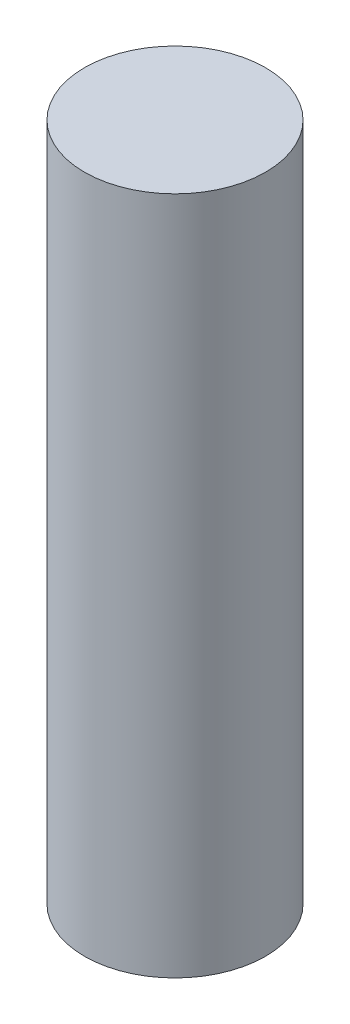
ISO-10303-21;
HEADER;
FILE_DESCRIPTION(('STEP AP214'),'2;1');
FILE_NAME('part.step','',(''),(''),'','','');
FILE_SCHEMA(('AUTOMOTIVE_DESIGN { 1 0 10303 214 1 1 1 1 }'));
ENDSEC;
DATA;
#1=APPLICATION_CONTEXT('core data for automotive mechanical design processes');
#2=APPLICATION_PROTOCOL_DEFINITION('international standard','automotive_design',2000,#1);
#3=PRODUCT_CONTEXT('',#1,'mechanical');
#4=PRODUCT('Part','Part','',(#3));
#5=PRODUCT_RELATED_PRODUCT_CATEGORY('part','',(#4));
#6=PRODUCT_DEFINITION_FORMATION('','',#4);
#7=PRODUCT_DEFINITION_CONTEXT('part definition',#1,'design');
#8=PRODUCT_DEFINITION('design','',#6,#7);
#9=PRODUCT_DEFINITION_SHAPE('','',#8);
#10=(LENGTH_UNIT() NAMED_UNIT(*) SI_UNIT(.MILLI.,.METRE.));
#11=(NAMED_UNIT(*) PLANE_ANGLE_UNIT() SI_UNIT($,.RADIAN.));
#12=(NAMED_UNIT(*) SI_UNIT($,.STERADIAN.) SOLID_ANGLE_UNIT());
#13=UNCERTAINTY_MEASURE_WITH_UNIT(LENGTH_MEASURE(1.E-05),#10,'distance_accuracy_value','');
#14=(GEOMETRIC_REPRESENTATION_CONTEXT(3) GLOBAL_UNCERTAINTY_ASSIGNED_CONTEXT((#13)) GLOBAL_UNIT_ASSIGNED_CONTEXT((#10,
#11,#12)) REPRESENTATION_CONTEXT('',''));
#15=CARTESIAN_POINT('',(0.,0.,0.));
#16=DIRECTION('',(0.,0.,1.));
#17=DIRECTION('',(1.,0.,0.));
#18=AXIS2_PLACEMENT_3D('',#15,#16,#17);
#19=CARTESIAN_POINT('',(0.,7.5,0.));
#20=DIRECTION('',(0.,-1.,0.));
#21=DIRECTION('',(0.,0.,-1.));
#22=AXIS2_PLACEMENT_3D('',#19,#20,#21);
#23=CYLINDRICAL_SURFACE('',#22,1.);
#24=CARTESIAN_POINT('',(0.,7.5,0.));
#25=DIRECTION('',(0.,1.,0.));
#26=DIRECTION('',(0.,0.,1.));
#27=AXIS2_PLACEMENT_3D('',#24,#25,#26);
#28=CIRCLE('',#27,1.);
#29=CARTESIAN_POINT('',(0.,7.5,1.));
#30=VERTEX_POINT('',#29);
#31=EDGE_CURVE('E10',#30,#30,#28,.T.);
#32=ORIENTED_EDGE('',*,*,#31,.F.);
#33=EDGE_LOOP('',(#32));
#34=FACE_BOUND('',#33,.T.);
#35=CARTESIAN_POINT('',(0.,0.,0.));
#36=DIRECTION('',(0.,1.,0.));
#37=DIRECTION('',(0.,0.,1.));
#38=AXIS2_PLACEMENT_3D('',#35,#36,#37);
#39=CIRCLE('',#38,1.);
#40=CARTESIAN_POINT('',(0.,0.,1.));
#41=VERTEX_POINT('',#40);
#42=EDGE_CURVE('E33',#41,#41,#39,.T.);
#43=ORIENTED_EDGE('',*,*,#42,.T.);
#44=EDGE_LOOP('',(#43));
#45=FACE_BOUND('',#44,.T.);
#46=ADVANCED_FACE('F30',(#34,#45),#23,.T.);
#47=CARTESIAN_POINT('',(0.,7.5,0.));
#48=DIRECTION('',(0.,1.,0.));
#49=DIRECTION('',(0.,0.,1.));
#50=AXIS2_PLACEMENT_3D('',#47,#48,#49);
#51=PLANE('',#50);
#52=ORIENTED_EDGE('',*,*,#31,.T.);
#53=EDGE_LOOP('',(#52));
#54=FACE_BOUND('',#53,.T.);
#55=ADVANCED_FACE('F45',(#54),#51,.T.);
#56=CARTESIAN_POINT('',(0.,0.,0.));
#57=DIRECTION('',(0.,1.,0.));
#58=DIRECTION('',(0.,0.,1.));
#59=AXIS2_PLACEMENT_3D('',#56,#57,#58);
#60=PLANE('',#59);
#61=ORIENTED_EDGE('',*,*,#42,.F.);
#62=EDGE_LOOP('',(#61));
#63=FACE_BOUND('',#62,.T.);
#64=ADVANCED_FACE('F43',(#63),#60,.F.);
#65=CLOSED_SHELL('',(#46,#55,#64));
#66=MANIFOLD_SOLID_BREP('B2',#65);
#67=ADVANCED_BREP_SHAPE_REPRESENTATION('',(#18,#66),#14);
#68=SHAPE_DEFINITION_REPRESENTATION(#9,#67);
ENDSEC;
END-ISO-10303-21;
